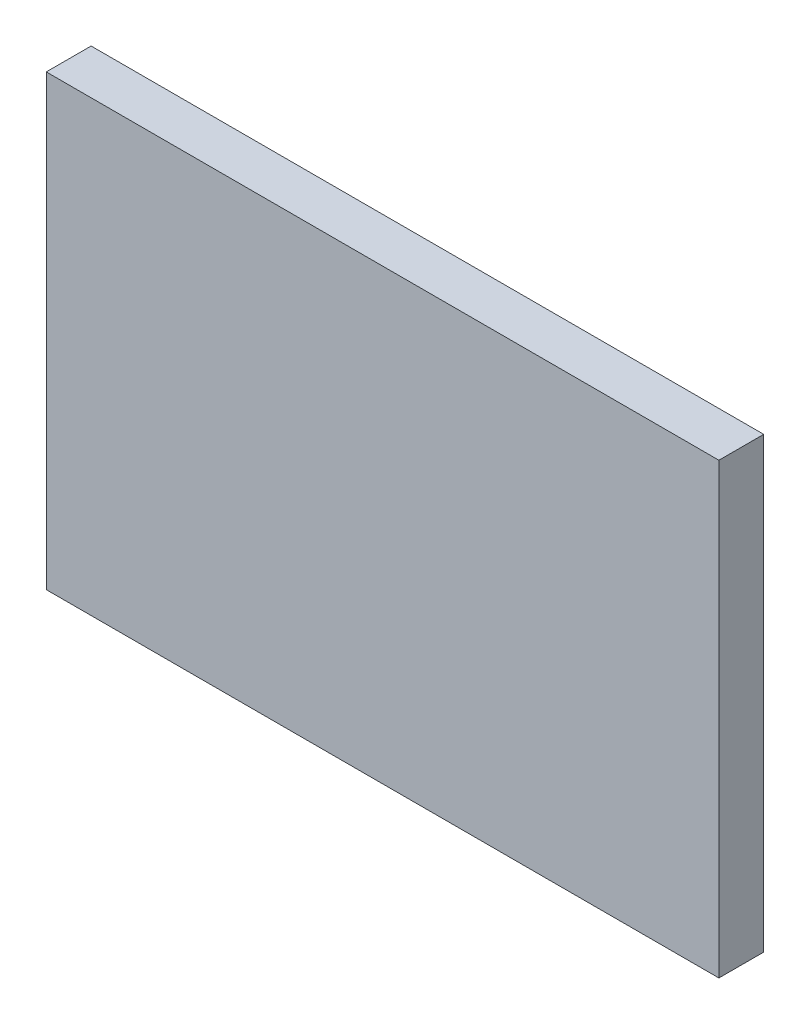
ISO-10303-21;
HEADER;
FILE_DESCRIPTION(('STEP AP214'),'2;1');
FILE_NAME('part.step','',(''),(''),'','','');
FILE_SCHEMA(('AUTOMOTIVE_DESIGN { 1 0 10303 214 1 1 1 1 }'));
ENDSEC;
DATA;
#1=APPLICATION_CONTEXT('core data for automotive mechanical design processes');
#2=APPLICATION_PROTOCOL_DEFINITION('international standard','automotive_design',2000,#1);
#3=PRODUCT_CONTEXT('',#1,'mechanical');
#4=PRODUCT('Part','Part','',(#3));
#5=PRODUCT_RELATED_PRODUCT_CATEGORY('part','',(#4));
#6=PRODUCT_DEFINITION_FORMATION('','',#4);
#7=PRODUCT_DEFINITION_CONTEXT('part definition',#1,'design');
#8=PRODUCT_DEFINITION('design','',#6,#7);
#9=PRODUCT_DEFINITION_SHAPE('','',#8);
#10=(LENGTH_UNIT() NAMED_UNIT(*) SI_UNIT(.MILLI.,.METRE.));
#11=(NAMED_UNIT(*) PLANE_ANGLE_UNIT() SI_UNIT($,.RADIAN.));
#12=(NAMED_UNIT(*) SI_UNIT($,.STERADIAN.) SOLID_ANGLE_UNIT());
#13=UNCERTAINTY_MEASURE_WITH_UNIT(LENGTH_MEASURE(1.E-05),#10,'distance_accuracy_value','');
#14=(GEOMETRIC_REPRESENTATION_CONTEXT(3) GLOBAL_UNCERTAINTY_ASSIGNED_CONTEXT((#13)) GLOBAL_UNIT_ASSIGNED_CONTEXT((#10,
#11,#12)) REPRESENTATION_CONTEXT('',''));
#15=CARTESIAN_POINT('',(0.,0.,0.));
#16=DIRECTION('',(0.,0.,1.));
#17=DIRECTION('',(1.,0.,0.));
#18=AXIS2_PLACEMENT_3D('',#15,#16,#17);
#19=CARTESIAN_POINT('',(-95.3947368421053,65.625,10.));
#20=DIRECTION('',(1.,0.,0.));
#21=DIRECTION('',(0.,1.,0.));
#22=AXIS2_PLACEMENT_3D('',#19,#20,#21);
#23=PLANE('',#22);
#24=DIRECTION('',(0.,-1.,0.));
#25=VECTOR('',#24,1.);
#26=CARTESIAN_POINT('',(-95.3947368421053,65.625,0.));
#27=LINE('',#26,#25);
#28=CARTESIAN_POINT('',(-95.3947368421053,65.625,0.));
#29=VERTEX_POINT('',#28);
#30=CARTESIAN_POINT('',(-95.3947368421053,-34.375,0.));
#31=VERTEX_POINT('',#30);
#32=EDGE_CURVE('E108',#29,#31,#27,.T.);
#33=ORIENTED_EDGE('',*,*,#32,.T.);
#34=DIRECTION('',(0.,0.,-1.));
#35=VECTOR('',#34,1.);
#36=CARTESIAN_POINT('',(-95.3947368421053,-34.375,10.));
#37=LINE('',#36,#35);
#38=CARTESIAN_POINT('',(-95.3947368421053,-34.375,10.));
#39=VERTEX_POINT('',#38);
#40=EDGE_CURVE('E12',#39,#31,#37,.T.);
#41=ORIENTED_EDGE('',*,*,#40,.F.);
#42=DIRECTION('',(0.,-1.,0.));
#43=VECTOR('',#42,1.);
#44=CARTESIAN_POINT('',(-95.3947368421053,65.625,10.));
#45=LINE('',#44,#43);
#46=CARTESIAN_POINT('',(-95.3947368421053,65.625,10.));
#47=VERTEX_POINT('',#46);
#48=EDGE_CURVE('E92',#47,#39,#45,.T.);
#49=ORIENTED_EDGE('',*,*,#48,.F.);
#50=DIRECTION('',(0.,0.,-1.));
#51=VECTOR('',#50,1.);
#52=CARTESIAN_POINT('',(-95.3947368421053,65.625,10.));
#53=LINE('',#52,#51);
#54=EDGE_CURVE('E100',#47,#29,#53,.T.);
#55=ORIENTED_EDGE('',*,*,#54,.T.);
#56=EDGE_LOOP('',(#33,#41,#49,#55));
#57=FACE_BOUND('',#56,.T.);
#58=ADVANCED_FACE('F41',(#57),#23,.F.);
#59=CARTESIAN_POINT('',(-95.3947368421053,-34.375,10.));
#60=DIRECTION('',(0.,1.,0.));
#61=DIRECTION('',(0.,0.,1.));
#62=AXIS2_PLACEMENT_3D('',#59,#60,#61);
#63=PLANE('',#62);
#64=DIRECTION('',(1.,0.,0.));
#65=VECTOR('',#64,1.);
#66=CARTESIAN_POINT('',(-95.3947368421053,-34.375,0.));
#67=LINE('',#66,#65);
#68=CARTESIAN_POINT('',(54.6052631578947,-34.375,0.));
#69=VERTEX_POINT('',#68);
#70=EDGE_CURVE('E96',#31,#69,#67,.T.);
#71=ORIENTED_EDGE('',*,*,#70,.T.);
#72=DIRECTION('',(0.,0.,-1.));
#73=VECTOR('',#72,1.);
#74=CARTESIAN_POINT('',(54.6052631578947,-34.375,10.));
#75=LINE('',#74,#73);
#76=CARTESIAN_POINT('',(54.6052631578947,-34.375,10.));
#77=VERTEX_POINT('',#76);
#78=EDGE_CURVE('E49',#77,#69,#75,.T.);
#79=ORIENTED_EDGE('',*,*,#78,.F.);
#80=DIRECTION('',(1.,0.,0.));
#81=VECTOR('',#80,1.);
#82=CARTESIAN_POINT('',(-95.3947368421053,-34.375,10.));
#83=LINE('',#82,#81);
#84=EDGE_CURVE('E87',#39,#77,#83,.T.);
#85=ORIENTED_EDGE('',*,*,#84,.F.);
#86=ORIENTED_EDGE('',*,*,#40,.T.);
#87=EDGE_LOOP('',(#71,#79,#85,#86));
#88=FACE_BOUND('',#87,.T.);
#89=ADVANCED_FACE('F95',(#88),#63,.F.);
#90=CARTESIAN_POINT('',(54.6052631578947,65.625,10.));
#91=DIRECTION('',(-1.,0.,0.));
#92=DIRECTION('',(0.,-1.,0.));
#93=AXIS2_PLACEMENT_3D('',#90,#91,#92);
#94=PLANE('',#93);
#95=DIRECTION('',(0.,1.,0.));
#96=VECTOR('',#95,1.);
#97=CARTESIAN_POINT('',(54.6052631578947,65.625,0.));
#98=LINE('',#97,#96);
#99=CARTESIAN_POINT('',(54.6052631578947,65.625,0.));
#100=VERTEX_POINT('',#99);
#101=EDGE_CURVE('E74',#69,#100,#98,.T.);
#102=ORIENTED_EDGE('',*,*,#101,.T.);
#103=DIRECTION('',(0.,0.,-1.));
#104=VECTOR('',#103,1.);
#105=CARTESIAN_POINT('',(54.6052631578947,65.625,10.));
#106=LINE('',#105,#104);
#107=CARTESIAN_POINT('',(54.6052631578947,65.625,10.));
#108=VERTEX_POINT('',#107);
#109=EDGE_CURVE('E97',#108,#100,#106,.T.);
#110=ORIENTED_EDGE('',*,*,#109,.F.);
#111=DIRECTION('',(0.,1.,0.));
#112=VECTOR('',#111,1.);
#113=CARTESIAN_POINT('',(54.6052631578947,65.625,10.));
#114=LINE('',#113,#112);
#115=EDGE_CURVE('E90',#77,#108,#114,.T.);
#116=ORIENTED_EDGE('',*,*,#115,.F.);
#117=ORIENTED_EDGE('',*,*,#78,.T.);
#118=EDGE_LOOP('',(#102,#110,#116,#117));
#119=FACE_BOUND('',#118,.T.);
#120=ADVANCED_FACE('F98',(#119),#94,.F.);
#121=CARTESIAN_POINT('',(-95.3947368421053,65.625,10.));
#122=DIRECTION('',(0.,-1.,0.));
#123=DIRECTION('',(0.,0.,-1.));
#124=AXIS2_PLACEMENT_3D('',#121,#122,#123);
#125=PLANE('',#124);
#126=DIRECTION('',(-1.,0.,0.));
#127=VECTOR('',#126,1.);
#128=CARTESIAN_POINT('',(-95.3947368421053,65.625,0.));
#129=LINE('',#128,#127);
#130=EDGE_CURVE('E80',#100,#29,#129,.T.);
#131=ORIENTED_EDGE('',*,*,#130,.T.);
#132=ORIENTED_EDGE('',*,*,#54,.F.);
#133=DIRECTION('',(-1.,0.,0.));
#134=VECTOR('',#133,1.);
#135=CARTESIAN_POINT('',(-95.3947368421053,65.625,10.));
#136=LINE('',#135,#134);
#137=EDGE_CURVE('E57',#108,#47,#136,.T.);
#138=ORIENTED_EDGE('',*,*,#137,.F.);
#139=ORIENTED_EDGE('',*,*,#109,.T.);
#140=EDGE_LOOP('',(#131,#132,#138,#139));
#141=FACE_BOUND('',#140,.T.);
#142=ADVANCED_FACE('F115',(#141),#125,.F.);
#143=CARTESIAN_POINT('',(0.,0.,10.));
#144=DIRECTION('',(0.,0.,1.));
#145=DIRECTION('',(1.,0.,0.));
#146=AXIS2_PLACEMENT_3D('',#143,#144,#145);
#147=PLANE('',#146);
#148=ORIENTED_EDGE('',*,*,#48,.T.);
#149=ORIENTED_EDGE('',*,*,#84,.T.);
#150=ORIENTED_EDGE('',*,*,#115,.T.);
#151=ORIENTED_EDGE('',*,*,#137,.T.);
#152=EDGE_LOOP('',(#148,#149,#150,#151));
#153=FACE_BOUND('',#152,.T.);
#154=ADVANCED_FACE('F88',(#153),#147,.T.);
#155=CARTESIAN_POINT('',(0.,0.,0.));
#156=DIRECTION('',(0.,0.,1.));
#157=DIRECTION('',(1.,0.,0.));
#158=AXIS2_PLACEMENT_3D('',#155,#156,#157);
#159=PLANE('',#158);
#160=ORIENTED_EDGE('',*,*,#32,.F.);
#161=ORIENTED_EDGE('',*,*,#130,.F.);
#162=ORIENTED_EDGE('',*,*,#101,.F.);
#163=ORIENTED_EDGE('',*,*,#70,.F.);
#164=EDGE_LOOP('',(#160,#161,#162,#163));
#165=FACE_BOUND('',#164,.T.);
#166=ADVANCED_FACE('F118',(#165),#159,.F.);
#167=CLOSED_SHELL('',(#58,#89,#120,#142,#154,#166));
#168=MANIFOLD_SOLID_BREP('B2',#167);
#169=ADVANCED_BREP_SHAPE_REPRESENTATION('',(#18,#168),#14);
#170=SHAPE_DEFINITION_REPRESENTATION(#9,#169);
ENDSEC;
END-ISO-10303-21;
